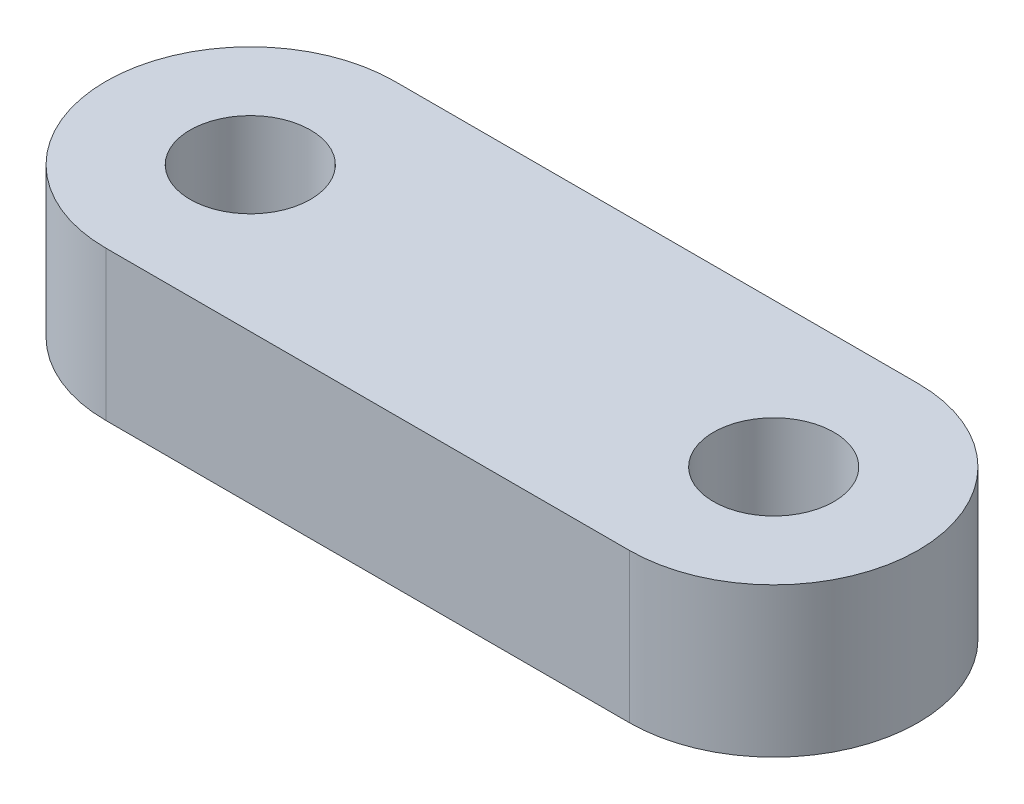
ISO-10303-21;
HEADER;
FILE_DESCRIPTION(('STEP AP214'),'2;1');
FILE_NAME('part.step','',(''),(''),'','','');
FILE_SCHEMA(('AUTOMOTIVE_DESIGN { 1 0 10303 214 1 1 1 1 }'));
ENDSEC;
DATA;
#1=APPLICATION_CONTEXT('core data for automotive mechanical design processes');
#2=APPLICATION_PROTOCOL_DEFINITION('international standard','automotive_design',2000,#1);
#3=PRODUCT_CONTEXT('',#1,'mechanical');
#4=PRODUCT('Part','Part','',(#3));
#5=PRODUCT_RELATED_PRODUCT_CATEGORY('part','',(#4));
#6=PRODUCT_DEFINITION_FORMATION('','',#4);
#7=PRODUCT_DEFINITION_CONTEXT('part definition',#1,'design');
#8=PRODUCT_DEFINITION('design','',#6,#7);
#9=PRODUCT_DEFINITION_SHAPE('','',#8);
#10=(LENGTH_UNIT() NAMED_UNIT(*) SI_UNIT(.MILLI.,.METRE.));
#11=(NAMED_UNIT(*) PLANE_ANGLE_UNIT() SI_UNIT($,.RADIAN.));
#12=(NAMED_UNIT(*) SI_UNIT($,.STERADIAN.) SOLID_ANGLE_UNIT());
#13=UNCERTAINTY_MEASURE_WITH_UNIT(LENGTH_MEASURE(1.E-05),#10,'distance_accuracy_value','');
#14=(GEOMETRIC_REPRESENTATION_CONTEXT(3) GLOBAL_UNCERTAINTY_ASSIGNED_CONTEXT((#13)) GLOBAL_UNIT_ASSIGNED_CONTEXT((#10,
#11,#12)) REPRESENTATION_CONTEXT('',''));
#15=CARTESIAN_POINT('',(0.,0.,0.));
#16=DIRECTION('',(0.,0.,1.));
#17=DIRECTION('',(1.,0.,0.));
#18=AXIS2_PLACEMENT_3D('',#15,#16,#17);
#19=CARTESIAN_POINT('',(10.87,-1.45,0.));
#20=DIRECTION('',(0.,1.,0.));
#21=DIRECTION('',(-1.,0.,0.));
#22=AXIS2_PLACEMENT_3D('',#19,#20,#21);
#23=CYLINDRICAL_SURFACE('',#22,3.);
#24=DIRECTION('',(0.,1.,0.));
#25=VECTOR('',#24,1.);
#26=CARTESIAN_POINT('',(10.87,-1.45,-3.));
#27=LINE('',#26,#25);
#28=CARTESIAN_POINT('',(10.87,-1.55,-3.));
#29=VERTEX_POINT('',#28);
#30=CARTESIAN_POINT('',(10.87,1.55,-3.));
#31=VERTEX_POINT('',#30);
#32=EDGE_CURVE('E38',#29,#31,#27,.T.);
#33=ORIENTED_EDGE('',*,*,#32,.T.);
#34=CARTESIAN_POINT('',(10.87,1.55,0.));
#35=DIRECTION('',(0.,-1.,0.));
#36=DIRECTION('',(-1.,0.,0.));
#37=AXIS2_PLACEMENT_3D('',#34,#35,#36);
#38=CIRCLE('',#37,3.);
#39=CARTESIAN_POINT('',(10.87,1.55,3.));
#40=VERTEX_POINT('',#39);
#41=EDGE_CURVE('E57',#31,#40,#38,.T.);
#42=ORIENTED_EDGE('',*,*,#41,.T.);
#43=DIRECTION('',(0.,1.,0.));
#44=VECTOR('',#43,1.);
#45=CARTESIAN_POINT('',(10.87,-1.45,3.));
#46=LINE('',#45,#44);
#47=CARTESIAN_POINT('',(10.87,-1.55,3.));
#48=VERTEX_POINT('',#47);
#49=EDGE_CURVE('E31',#48,#40,#46,.T.);
#50=ORIENTED_EDGE('',*,*,#49,.F.);
#51=CARTESIAN_POINT('',(10.87,-1.55,0.));
#52=DIRECTION('',(0.,-1.,0.));
#53=DIRECTION('',(1.,0.,0.));
#54=AXIS2_PLACEMENT_3D('',#51,#52,#53);
#55=CIRCLE('',#54,3.);
#56=EDGE_CURVE('E55',#29,#48,#55,.T.);
#57=ORIENTED_EDGE('',*,*,#56,.F.);
#58=EDGE_LOOP('',(#33,#42,#50,#57));
#59=FACE_BOUND('',#58,.T.);
#60=ADVANCED_FACE('F14',(#59),#23,.T.);
#61=CARTESIAN_POINT('',(10.87,-1.45,3.));
#62=DIRECTION('',(0.,0.,-1.));
#63=DIRECTION('',(0.,1.,0.));
#64=AXIS2_PLACEMENT_3D('',#61,#62,#63);
#65=PLANE('',#64);
#66=ORIENTED_EDGE('',*,*,#49,.T.);
#67=DIRECTION('',(-1.,0.,0.));
#68=VECTOR('',#67,1.);
#69=CARTESIAN_POINT('',(10.87,1.55,3.));
#70=LINE('',#69,#68);
#71=CARTESIAN_POINT('',(0.,1.55,3.));
#72=VERTEX_POINT('',#71);
#73=EDGE_CURVE('E81',#40,#72,#70,.T.);
#74=ORIENTED_EDGE('',*,*,#73,.T.);
#75=DIRECTION('',(0.,1.,0.));
#76=VECTOR('',#75,1.);
#77=CARTESIAN_POINT('',(0.,-1.45,3.));
#78=LINE('',#77,#76);
#79=CARTESIAN_POINT('',(0.,-1.55,3.));
#80=VERTEX_POINT('',#79);
#81=EDGE_CURVE('E9',#80,#72,#78,.T.);
#82=ORIENTED_EDGE('',*,*,#81,.F.);
#83=DIRECTION('',(-1.,0.,0.));
#84=VECTOR('',#83,1.);
#85=CARTESIAN_POINT('',(10.87,-1.55,3.));
#86=LINE('',#85,#84);
#87=EDGE_CURVE('E61',#48,#80,#86,.T.);
#88=ORIENTED_EDGE('',*,*,#87,.F.);
#89=EDGE_LOOP('',(#66,#74,#82,#88));
#90=FACE_BOUND('',#89,.T.);
#91=ADVANCED_FACE('F62',(#90),#65,.F.);
#92=CARTESIAN_POINT('',(0.,-1.45,-3.));
#93=DIRECTION('',(0.,0.,1.));
#94=DIRECTION('',(0.,-1.,0.));
#95=AXIS2_PLACEMENT_3D('',#92,#93,#94);
#96=PLANE('',#95);
#97=DIRECTION('',(0.,1.,0.));
#98=VECTOR('',#97,1.);
#99=CARTESIAN_POINT('',(0.,-1.45,-3.));
#100=LINE('',#99,#98);
#101=CARTESIAN_POINT('',(0.,-1.55,-3.));
#102=VERTEX_POINT('',#101);
#103=CARTESIAN_POINT('',(0.,1.55,-3.));
#104=VERTEX_POINT('',#103);
#105=EDGE_CURVE('E23',#102,#104,#100,.T.);
#106=ORIENTED_EDGE('',*,*,#105,.T.);
#107=DIRECTION('',(1.,0.,0.));
#108=VECTOR('',#107,1.);
#109=CARTESIAN_POINT('',(0.,1.55,-3.));
#110=LINE('',#109,#108);
#111=EDGE_CURVE('E89',#104,#31,#110,.T.);
#112=ORIENTED_EDGE('',*,*,#111,.T.);
#113=ORIENTED_EDGE('',*,*,#32,.F.);
#114=DIRECTION('',(1.,0.,0.));
#115=VECTOR('',#114,1.);
#116=CARTESIAN_POINT('',(0.,-1.55,-3.));
#117=LINE('',#116,#115);
#118=EDGE_CURVE('E72',#102,#29,#117,.T.);
#119=ORIENTED_EDGE('',*,*,#118,.F.);
#120=EDGE_LOOP('',(#106,#112,#113,#119));
#121=FACE_BOUND('',#120,.T.);
#122=ADVANCED_FACE('F130',(#121),#96,.F.);
#123=CARTESIAN_POINT('',(0.,-1.45,0.));
#124=DIRECTION('',(0.,1.,0.));
#125=DIRECTION('',(-1.,0.,0.));
#126=AXIS2_PLACEMENT_3D('',#123,#124,#125);
#127=CYLINDRICAL_SURFACE('',#126,3.);
#128=ORIENTED_EDGE('',*,*,#81,.T.);
#129=CARTESIAN_POINT('',(0.,1.55,0.));
#130=DIRECTION('',(0.,-1.,0.));
#131=DIRECTION('',(1.,0.,0.));
#132=AXIS2_PLACEMENT_3D('',#129,#130,#131);
#133=CIRCLE('',#132,3.);
#134=EDGE_CURVE('E85',#72,#104,#133,.T.);
#135=ORIENTED_EDGE('',*,*,#134,.T.);
#136=ORIENTED_EDGE('',*,*,#105,.F.);
#137=CARTESIAN_POINT('',(0.,-1.55,0.));
#138=DIRECTION('',(0.,-1.,0.));
#139=DIRECTION('',(1.,0.,0.));
#140=AXIS2_PLACEMENT_3D('',#137,#138,#139);
#141=CIRCLE('',#140,3.);
#142=EDGE_CURVE('E66',#80,#102,#141,.T.);
#143=ORIENTED_EDGE('',*,*,#142,.F.);
#144=EDGE_LOOP('',(#128,#135,#136,#143));
#145=FACE_BOUND('',#144,.T.);
#146=ADVANCED_FACE('F135',(#145),#127,.T.);
#147=CARTESIAN_POINT('',(10.87,-1.45,0.));
#148=DIRECTION('',(0.,1.,0.));
#149=DIRECTION('',(-1.,0.,0.));
#150=AXIS2_PLACEMENT_3D('',#147,#148,#149);
#151=CYLINDRICAL_SURFACE('',#150,1.25);
#152=CARTESIAN_POINT('',(10.87,1.55,0.));
#153=DIRECTION('',(0.,-1.,0.));
#154=DIRECTION('',(1.,0.,0.));
#155=AXIS2_PLACEMENT_3D('',#152,#153,#154);
#156=CIRCLE('',#155,1.25);
#157=CARTESIAN_POINT('',(12.12,1.55,0.));
#158=VERTEX_POINT('',#157);
#159=EDGE_CURVE('E94',#158,#158,#156,.T.);
#160=ORIENTED_EDGE('',*,*,#159,.F.);
#161=EDGE_LOOP('',(#160));
#162=FACE_BOUND('',#161,.T.);
#163=CARTESIAN_POINT('',(10.87,-1.55,0.));
#164=DIRECTION('',(0.,-1.,0.));
#165=DIRECTION('',(1.,0.,0.));
#166=AXIS2_PLACEMENT_3D('',#163,#164,#165);
#167=CIRCLE('',#166,1.25);
#168=CARTESIAN_POINT('',(12.12,-1.55,0.));
#169=VERTEX_POINT('',#168);
#170=EDGE_CURVE('E73',#169,#169,#167,.T.);
#171=ORIENTED_EDGE('',*,*,#170,.T.);
#172=EDGE_LOOP('',(#171));
#173=FACE_BOUND('',#172,.T.);
#174=ADVANCED_FACE('F111',(#162,#173),#151,.F.);
#175=CARTESIAN_POINT('',(0.,-1.45,0.));
#176=DIRECTION('',(0.,1.,0.));
#177=DIRECTION('',(-1.,0.,0.));
#178=AXIS2_PLACEMENT_3D('',#175,#176,#177);
#179=CYLINDRICAL_SURFACE('',#178,1.25);
#180=CARTESIAN_POINT('',(0.,1.55,0.));
#181=DIRECTION('',(0.,-1.,0.));
#182=DIRECTION('',(1.,0.,0.));
#183=AXIS2_PLACEMENT_3D('',#180,#181,#182);
#184=CIRCLE('',#183,1.25);
#185=CARTESIAN_POINT('',(1.25,1.55,0.));
#186=VERTEX_POINT('',#185);
#187=EDGE_CURVE('E18',#186,#186,#184,.T.);
#188=ORIENTED_EDGE('',*,*,#187,.F.);
#189=EDGE_LOOP('',(#188));
#190=FACE_BOUND('',#189,.T.);
#191=CARTESIAN_POINT('',(0.,-1.55,0.));
#192=DIRECTION('',(0.,-1.,0.));
#193=DIRECTION('',(1.,0.,0.));
#194=AXIS2_PLACEMENT_3D('',#191,#192,#193);
#195=CIRCLE('',#194,1.25);
#196=CARTESIAN_POINT('',(1.25,-1.55,0.));
#197=VERTEX_POINT('',#196);
#198=EDGE_CURVE('E76',#197,#197,#195,.T.);
#199=ORIENTED_EDGE('',*,*,#198,.T.);
#200=EDGE_LOOP('',(#199));
#201=FACE_BOUND('',#200,.T.);
#202=ADVANCED_FACE('F108',(#190,#201),#179,.F.);
#203=CARTESIAN_POINT('',(0.,1.55,0.));
#204=DIRECTION('',(0.,-1.,0.));
#205=DIRECTION('',(1.,0.,0.));
#206=AXIS2_PLACEMENT_3D('',#203,#204,#205);
#207=PLANE('',#206);
#208=ORIENTED_EDGE('',*,*,#187,.T.);
#209=EDGE_LOOP('',(#208));
#210=FACE_BOUND('',#209,.T.);
#211=ORIENTED_EDGE('',*,*,#159,.T.);
#212=EDGE_LOOP('',(#211));
#213=FACE_BOUND('',#212,.T.);
#214=ORIENTED_EDGE('',*,*,#73,.F.);
#215=ORIENTED_EDGE('',*,*,#41,.F.);
#216=ORIENTED_EDGE('',*,*,#111,.F.);
#217=ORIENTED_EDGE('',*,*,#134,.F.);
#218=EDGE_LOOP('',(#214,#215,#216,#217));
#219=FACE_BOUND('',#218,.T.);
#220=ADVANCED_FACE('F16',(#210,#213,#219),#207,.F.);
#221=CARTESIAN_POINT('',(10.87,-1.55,0.));
#222=DIRECTION('',(0.,-1.,0.));
#223=DIRECTION('',(1.,0.,0.));
#224=AXIS2_PLACEMENT_3D('',#221,#222,#223);
#225=PLANE('',#224);
#226=ORIENTED_EDGE('',*,*,#170,.F.);
#227=EDGE_LOOP('',(#226));
#228=FACE_BOUND('',#227,.T.);
#229=ORIENTED_EDGE('',*,*,#56,.T.);
#230=ORIENTED_EDGE('',*,*,#87,.T.);
#231=ORIENTED_EDGE('',*,*,#142,.T.);
#232=ORIENTED_EDGE('',*,*,#118,.T.);
#233=EDGE_LOOP('',(#229,#230,#231,#232));
#234=FACE_BOUND('',#233,.T.);
#235=ORIENTED_EDGE('',*,*,#198,.F.);
#236=EDGE_LOOP('',(#235));
#237=FACE_BOUND('',#236,.T.);
#238=ADVANCED_FACE('F69',(#228,#234,#237),#225,.T.);
#239=CLOSED_SHELL('',(#60,#91,#122,#146,#174,#202,#220,#238));
#240=MANIFOLD_SOLID_BREP('B1',#239);
#241=ADVANCED_BREP_SHAPE_REPRESENTATION('',(#18,#240),#14);
#242=SHAPE_DEFINITION_REPRESENTATION(#9,#241);
ENDSEC;
END-ISO-10303-21;
